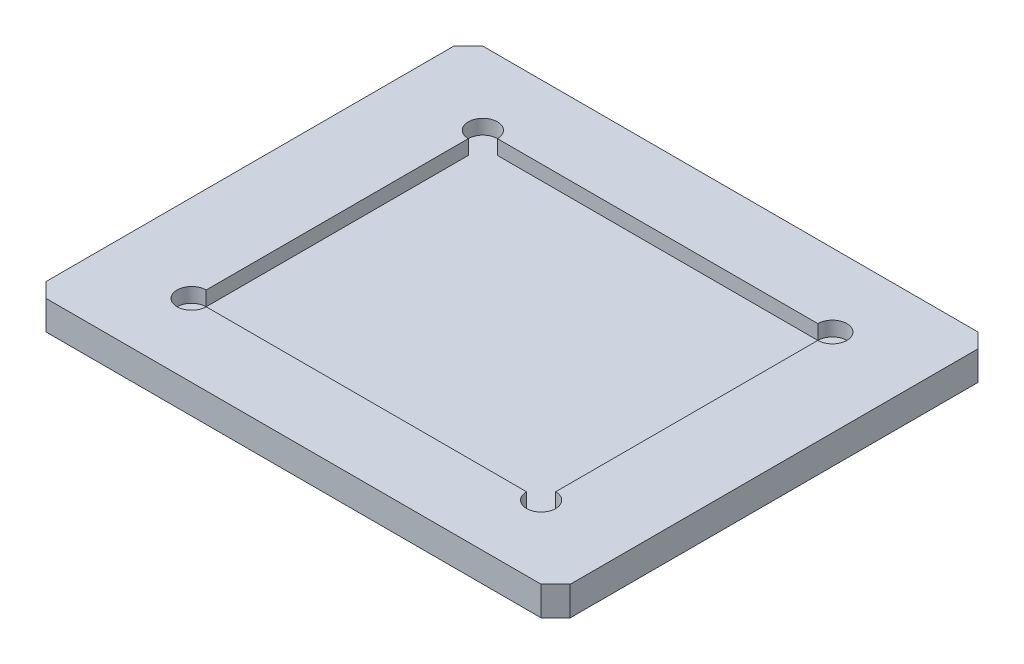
ISO-10303-21;
HEADER;
FILE_DESCRIPTION(('STEP AP214'),'2;1');
FILE_NAME('part.step','',(''),(''),'','','');
FILE_SCHEMA(('AUTOMOTIVE_DESIGN { 1 0 10303 214 1 1 1 1 }'));
ENDSEC;
DATA;
#1=APPLICATION_CONTEXT('core data for automotive mechanical design processes');
#2=APPLICATION_PROTOCOL_DEFINITION('international standard','automotive_design',2000,#1);
#3=PRODUCT_CONTEXT('',#1,'mechanical');
#4=PRODUCT('Part','Part','',(#3));
#5=PRODUCT_RELATED_PRODUCT_CATEGORY('part','',(#4));
#6=PRODUCT_DEFINITION_FORMATION('','',#4);
#7=PRODUCT_DEFINITION_CONTEXT('part definition',#1,'design');
#8=PRODUCT_DEFINITION('design','',#6,#7);
#9=PRODUCT_DEFINITION_SHAPE('','',#8);
#10=(LENGTH_UNIT() NAMED_UNIT(*) SI_UNIT(.MILLI.,.METRE.));
#11=(NAMED_UNIT(*) PLANE_ANGLE_UNIT() SI_UNIT($,.RADIAN.));
#12=(NAMED_UNIT(*) SI_UNIT($,.STERADIAN.) SOLID_ANGLE_UNIT());
#13=UNCERTAINTY_MEASURE_WITH_UNIT(LENGTH_MEASURE(1.E-05),#10,'distance_accuracy_value','');
#14=(GEOMETRIC_REPRESENTATION_CONTEXT(3) GLOBAL_UNCERTAINTY_ASSIGNED_CONTEXT((#13)) GLOBAL_UNIT_ASSIGNED_CONTEXT((#10,
#11,#12)) REPRESENTATION_CONTEXT('',''));
#15=CARTESIAN_POINT('',(0.,0.,0.));
#16=DIRECTION('',(0.,0.,1.));
#17=DIRECTION('',(1.,0.,0.));
#18=AXIS2_PLACEMENT_3D('',#15,#16,#17);
#19=CARTESIAN_POINT('',(90.,0.,75.));
#20=DIRECTION('',(1.,0.,0.));
#21=DIRECTION('',(0.,0.,-1.));
#22=AXIS2_PLACEMENT_3D('',#19,#20,#21);
#23=PLANE('',#22);
#24=DIRECTION('',(0.,0.,-1.));
#25=VECTOR('',#24,1.);
#26=CARTESIAN_POINT('',(90.,0.,75.));
#27=LINE('',#26,#25);
#28=CARTESIAN_POINT('',(90.,0.,70.));
#29=VERTEX_POINT('',#28);
#30=CARTESIAN_POINT('',(90.,0.,-70.));
#31=VERTEX_POINT('',#30);
#32=EDGE_CURVE('E225',#29,#31,#27,.T.);
#33=ORIENTED_EDGE('',*,*,#32,.T.);
#34=DIRECTION('',(0.,1.,0.));
#35=VECTOR('',#34,1.);
#36=CARTESIAN_POINT('',(90.,0.,-70.));
#37=LINE('',#36,#35);
#38=CARTESIAN_POINT('',(90.,10.,-70.));
#39=VERTEX_POINT('',#38);
#40=EDGE_CURVE('E258',#31,#39,#37,.T.);
#41=ORIENTED_EDGE('',*,*,#40,.T.);
#42=DIRECTION('',(0.,0.,-1.));
#43=VECTOR('',#42,1.);
#44=CARTESIAN_POINT('',(90.,10.,75.));
#45=LINE('',#44,#43);
#46=CARTESIAN_POINT('',(90.,10.,70.));
#47=VERTEX_POINT('',#46);
#48=EDGE_CURVE('E204',#47,#39,#45,.T.);
#49=ORIENTED_EDGE('',*,*,#48,.F.);
#50=DIRECTION('',(0.,-1.,0.));
#51=VECTOR('',#50,1.);
#52=CARTESIAN_POINT('',(90.,0.,70.));
#53=LINE('',#52,#51);
#54=EDGE_CURVE('E241',#47,#29,#53,.T.);
#55=ORIENTED_EDGE('',*,*,#54,.T.);
#56=EDGE_LOOP('',(#33,#41,#49,#55));
#57=FACE_BOUND('',#56,.T.);
#58=ADVANCED_FACE('F53',(#57),#23,.T.);
#59=CARTESIAN_POINT('',(-90.,0.,75.));
#60=DIRECTION('',(0.,0.,1.));
#61=DIRECTION('',(1.,0.,0.));
#62=AXIS2_PLACEMENT_3D('',#59,#60,#61);
#63=PLANE('',#62);
#64=DIRECTION('',(1.,0.,0.));
#65=VECTOR('',#64,1.);
#66=CARTESIAN_POINT('',(-90.,0.,75.));
#67=LINE('',#66,#65);
#68=CARTESIAN_POINT('',(-85.,0.,75.));
#69=VERTEX_POINT('',#68);
#70=CARTESIAN_POINT('',(84.9999999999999,0.,75.));
#71=VERTEX_POINT('',#70);
#72=EDGE_CURVE('E237',#69,#71,#67,.T.);
#73=ORIENTED_EDGE('',*,*,#72,.T.);
#74=DIRECTION('',(0.,1.,0.));
#75=VECTOR('',#74,1.);
#76=CARTESIAN_POINT('',(85.,0.,75.));
#77=LINE('',#76,#75);
#78=CARTESIAN_POINT('',(84.9999999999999,10.,75.));
#79=VERTEX_POINT('',#78);
#80=EDGE_CURVE('E12',#71,#79,#77,.T.);
#81=ORIENTED_EDGE('',*,*,#80,.T.);
#82=DIRECTION('',(1.,0.,0.));
#83=VECTOR('',#82,1.);
#84=CARTESIAN_POINT('',(-90.,10.,75.));
#85=LINE('',#84,#83);
#86=CARTESIAN_POINT('',(-85.,10.,75.));
#87=VERTEX_POINT('',#86);
#88=EDGE_CURVE('E230',#87,#79,#85,.T.);
#89=ORIENTED_EDGE('',*,*,#88,.F.);
#90=DIRECTION('',(0.,-1.,0.));
#91=VECTOR('',#90,1.);
#92=CARTESIAN_POINT('',(-85.,0.,75.));
#93=LINE('',#92,#91);
#94=EDGE_CURVE('E63',#87,#69,#93,.T.);
#95=ORIENTED_EDGE('',*,*,#94,.T.);
#96=EDGE_LOOP('',(#73,#81,#89,#95));
#97=FACE_BOUND('',#96,.T.);
#98=ADVANCED_FACE('F301',(#97),#63,.T.);
#99=CARTESIAN_POINT('',(-90.,0.,-75.));
#100=DIRECTION('',(-1.,0.,0.));
#101=DIRECTION('',(0.,0.,1.));
#102=AXIS2_PLACEMENT_3D('',#99,#100,#101);
#103=PLANE('',#102);
#104=DIRECTION('',(0.,0.,1.));
#105=VECTOR('',#104,1.);
#106=CARTESIAN_POINT('',(-90.,10.,-75.));
#107=LINE('',#106,#105);
#108=CARTESIAN_POINT('',(-90.,10.,-70.));
#109=VERTEX_POINT('',#108);
#110=CARTESIAN_POINT('',(-90.,10.,70.));
#111=VERTEX_POINT('',#110);
#112=EDGE_CURVE('E249',#109,#111,#107,.T.);
#113=ORIENTED_EDGE('',*,*,#112,.F.);
#114=DIRECTION('',(0.,-1.,0.));
#115=VECTOR('',#114,1.);
#116=CARTESIAN_POINT('',(-90.,0.,-70.));
#117=LINE('',#116,#115);
#118=CARTESIAN_POINT('',(-90.,0.,-70.));
#119=VERTEX_POINT('',#118);
#120=EDGE_CURVE('E77',#109,#119,#117,.T.);
#121=ORIENTED_EDGE('',*,*,#120,.T.);
#122=DIRECTION('',(0.,0.,1.));
#123=VECTOR('',#122,1.);
#124=CARTESIAN_POINT('',(-90.,0.,-75.));
#125=LINE('',#124,#123);
#126=CARTESIAN_POINT('',(-90.,0.,70.));
#127=VERTEX_POINT('',#126);
#128=EDGE_CURVE('E234',#119,#127,#125,.T.);
#129=ORIENTED_EDGE('',*,*,#128,.T.);
#130=DIRECTION('',(0.,1.,0.));
#131=VECTOR('',#130,1.);
#132=CARTESIAN_POINT('',(-90.,0.,70.));
#133=LINE('',#132,#131);
#134=EDGE_CURVE('E292',#127,#111,#133,.T.);
#135=ORIENTED_EDGE('',*,*,#134,.T.);
#136=EDGE_LOOP('',(#113,#121,#129,#135));
#137=FACE_BOUND('',#136,.T.);
#138=ADVANCED_FACE('F309',(#137),#103,.T.);
#139=CARTESIAN_POINT('',(90.,0.,-75.));
#140=DIRECTION('',(0.,0.,-1.));
#141=DIRECTION('',(-1.,0.,0.));
#142=AXIS2_PLACEMENT_3D('',#139,#140,#141);
#143=PLANE('',#142);
#144=DIRECTION('',(-1.,0.,0.));
#145=VECTOR('',#144,1.);
#146=CARTESIAN_POINT('',(90.,10.,-75.));
#147=LINE('',#146,#145);
#148=CARTESIAN_POINT('',(84.9999999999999,10.,-75.));
#149=VERTEX_POINT('',#148);
#150=CARTESIAN_POINT('',(-85.,10.,-75.));
#151=VERTEX_POINT('',#150);
#152=EDGE_CURVE('E245',#149,#151,#147,.T.);
#153=ORIENTED_EDGE('',*,*,#152,.F.);
#154=DIRECTION('',(0.,-1.,0.));
#155=VECTOR('',#154,1.);
#156=CARTESIAN_POINT('',(84.9999999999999,0.,-75.));
#157=LINE('',#156,#155);
#158=CARTESIAN_POINT('',(84.9999999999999,0.,-75.));
#159=VERTEX_POINT('',#158);
#160=EDGE_CURVE('E278',#149,#159,#157,.T.);
#161=ORIENTED_EDGE('',*,*,#160,.T.);
#162=DIRECTION('',(-1.,0.,0.));
#163=VECTOR('',#162,1.);
#164=CARTESIAN_POINT('',(90.,0.,-75.));
#165=LINE('',#164,#163);
#166=CARTESIAN_POINT('',(-85.,0.,-75.));
#167=VERTEX_POINT('',#166);
#168=EDGE_CURVE('E229',#159,#167,#165,.T.);
#169=ORIENTED_EDGE('',*,*,#168,.T.);
#170=DIRECTION('',(0.,1.,0.));
#171=VECTOR('',#170,1.);
#172=CARTESIAN_POINT('',(-85.,0.,-75.));
#173=LINE('',#172,#171);
#174=EDGE_CURVE('E274',#167,#151,#173,.T.);
#175=ORIENTED_EDGE('',*,*,#174,.T.);
#176=EDGE_LOOP('',(#153,#161,#169,#175));
#177=FACE_BOUND('',#176,.T.);
#178=ADVANCED_FACE('F318',(#177),#143,.T.);
#179=CARTESIAN_POINT('',(0.,0.,0.));
#180=DIRECTION('',(0.,1.,0.));
#181=DIRECTION('',(0.,0.,1.));
#182=AXIS2_PLACEMENT_3D('',#179,#180,#181);
#183=PLANE('',#182);
#184=ORIENTED_EDGE('',*,*,#168,.F.);
#185=DIRECTION('',(-0.707106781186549,0.,-0.707106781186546));
#186=VECTOR('',#185,1.);
#187=CARTESIAN_POINT('',(90.,0.,-70.));
#188=LINE('',#187,#186);
#189=EDGE_CURVE('E289',#159,#31,#188,.F.);
#190=ORIENTED_EDGE('',*,*,#189,.T.);
#191=ORIENTED_EDGE('',*,*,#32,.F.);
#192=DIRECTION('',(0.707106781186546,0.,-0.707106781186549));
#193=VECTOR('',#192,1.);
#194=CARTESIAN_POINT('',(85.,0.,75.));
#195=LINE('',#194,#193);
#196=EDGE_CURVE('E283',#29,#71,#195,.F.);
#197=ORIENTED_EDGE('',*,*,#196,.T.);
#198=ORIENTED_EDGE('',*,*,#72,.F.);
#199=DIRECTION('',(0.707106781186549,0.,0.707106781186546));
#200=VECTOR('',#199,1.);
#201=CARTESIAN_POINT('',(-90.,0.,70.));
#202=LINE('',#201,#200);
#203=EDGE_CURVE('E70',#69,#127,#202,.F.);
#204=ORIENTED_EDGE('',*,*,#203,.T.);
#205=ORIENTED_EDGE('',*,*,#128,.F.);
#206=DIRECTION('',(-0.707106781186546,0.,0.707106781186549));
#207=VECTOR('',#206,1.);
#208=CARTESIAN_POINT('',(-85.,0.,-75.));
#209=LINE('',#208,#207);
#210=EDGE_CURVE('E286',#119,#167,#209,.F.);
#211=ORIENTED_EDGE('',*,*,#210,.T.);
#212=EDGE_LOOP('',(#184,#190,#191,#197,#198,#204,#205,#211));
#213=FACE_BOUND('',#212,.T.);
#214=ADVANCED_FACE('F305',(#213),#183,.F.);
#215=CARTESIAN_POINT('',(0.,10.,0.));
#216=DIRECTION('',(0.,1.,0.));
#217=DIRECTION('',(0.,0.,1.));
#218=AXIS2_PLACEMENT_3D('',#215,#216,#217);
#219=PLANE('',#218);
#220=CARTESIAN_POINT('',(60.,10.,50.));
#221=DIRECTION('',(0.,1.,0.));
#222=DIRECTION('',(0.,0.,1.));
#223=AXIS2_PLACEMENT_3D('',#220,#221,#222);
#224=CIRCLE('',#223,5.00000000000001);
#225=CARTESIAN_POINT('',(55.,10.,50.));
#226=VERTEX_POINT('',#225);
#227=CARTESIAN_POINT('',(60.,10.,45.));
#228=VERTEX_POINT('',#227);
#229=EDGE_CURVE('E192',#226,#228,#224,.T.);
#230=ORIENTED_EDGE('',*,*,#229,.F.);
#231=DIRECTION('',(1.,0.,0.));
#232=VECTOR('',#231,1.);
#233=CARTESIAN_POINT('',(-60.,10.,50.));
#234=LINE('',#233,#232);
#235=CARTESIAN_POINT('',(-55.,10.,50.));
#236=VERTEX_POINT('',#235);
#237=EDGE_CURVE('E190',#236,#226,#234,.T.);
#238=ORIENTED_EDGE('',*,*,#237,.F.);
#239=CARTESIAN_POINT('',(-60.,10.,50.));
#240=DIRECTION('',(0.,1.,0.));
#241=DIRECTION('',(0.,0.,1.));
#242=AXIS2_PLACEMENT_3D('',#239,#240,#241);
#243=CIRCLE('',#242,5.00000000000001);
#244=CARTESIAN_POINT('',(-60.,10.,45.));
#245=VERTEX_POINT('',#244);
#246=EDGE_CURVE('E524',#245,#236,#243,.T.);
#247=ORIENTED_EDGE('',*,*,#246,.F.);
#248=DIRECTION('',(0.,0.,1.));
#249=VECTOR('',#248,1.);
#250=CARTESIAN_POINT('',(-60.,10.,-50.));
#251=LINE('',#250,#249);
#252=CARTESIAN_POINT('',(-60.,10.,-45.));
#253=VERTEX_POINT('',#252);
#254=EDGE_CURVE('E214',#253,#245,#251,.T.);
#255=ORIENTED_EDGE('',*,*,#254,.F.);
#256=CARTESIAN_POINT('',(-60.,10.,-50.));
#257=DIRECTION('',(0.,1.,0.));
#258=DIRECTION('',(0.,0.,1.));
#259=AXIS2_PLACEMENT_3D('',#256,#257,#258);
#260=CIRCLE('',#259,5.00000000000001);
#261=CARTESIAN_POINT('',(-55.,10.,-50.));
#262=VERTEX_POINT('',#261);
#263=EDGE_CURVE('E181',#262,#253,#260,.T.);
#264=ORIENTED_EDGE('',*,*,#263,.F.);
#265=DIRECTION('',(-1.,0.,0.));
#266=VECTOR('',#265,1.);
#267=CARTESIAN_POINT('',(60.,10.,-50.));
#268=LINE('',#267,#266);
#269=CARTESIAN_POINT('',(55.,10.,-50.));
#270=VERTEX_POINT('',#269);
#271=EDGE_CURVE('E210',#270,#262,#268,.T.);
#272=ORIENTED_EDGE('',*,*,#271,.F.);
#273=CARTESIAN_POINT('',(60.,10.,-50.));
#274=DIRECTION('',(0.,1.,0.));
#275=DIRECTION('',(0.,0.,1.));
#276=AXIS2_PLACEMENT_3D('',#273,#274,#275);
#277=CIRCLE('',#276,5.00000000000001);
#278=CARTESIAN_POINT('',(60.,10.,-45.));
#279=VERTEX_POINT('',#278);
#280=EDGE_CURVE('E513',#279,#270,#277,.T.);
#281=ORIENTED_EDGE('',*,*,#280,.F.);
#282=DIRECTION('',(0.,0.,-1.));
#283=VECTOR('',#282,1.);
#284=CARTESIAN_POINT('',(60.,10.,50.));
#285=LINE('',#284,#283);
#286=EDGE_CURVE('E221',#228,#279,#285,.T.);
#287=ORIENTED_EDGE('',*,*,#286,.F.);
#288=EDGE_LOOP('',(#230,#238,#247,#255,#264,#272,#281,#287));
#289=FACE_BOUND('',#288,.T.);
#290=ORIENTED_EDGE('',*,*,#48,.T.);
#291=DIRECTION('',(0.707106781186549,0.,0.707106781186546));
#292=VECTOR('',#291,1.);
#293=CARTESIAN_POINT('',(79.9999999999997,10.,-80.0000000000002));
#294=LINE('',#293,#292);
#295=EDGE_CURVE('E271',#39,#149,#294,.F.);
#296=ORIENTED_EDGE('',*,*,#295,.T.);
#297=ORIENTED_EDGE('',*,*,#152,.T.);
#298=DIRECTION('',(0.707106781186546,0.,-0.707106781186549));
#299=VECTOR('',#298,1.);
#300=CARTESIAN_POINT('',(-80.0000000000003,10.,-79.9999999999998));
#301=LINE('',#300,#299);
#302=EDGE_CURVE('E268',#151,#109,#301,.F.);
#303=ORIENTED_EDGE('',*,*,#302,.T.);
#304=ORIENTED_EDGE('',*,*,#112,.T.);
#305=DIRECTION('',(-0.707106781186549,0.,-0.707106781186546));
#306=VECTOR('',#305,1.);
#307=CARTESIAN_POINT('',(-79.9999999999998,10.,80.0000000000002));
#308=LINE('',#307,#306);
#309=EDGE_CURVE('E262',#111,#87,#308,.F.);
#310=ORIENTED_EDGE('',*,*,#309,.T.);
#311=ORIENTED_EDGE('',*,*,#88,.T.);
#312=DIRECTION('',(-0.707106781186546,0.,0.707106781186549));
#313=VECTOR('',#312,1.);
#314=CARTESIAN_POINT('',(80.0000000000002,10.,79.9999999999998));
#315=LINE('',#314,#313);
#316=EDGE_CURVE('E265',#79,#47,#315,.F.);
#317=ORIENTED_EDGE('',*,*,#316,.T.);
#318=EDGE_LOOP('',(#290,#296,#297,#303,#304,#310,#311,#317));
#319=FACE_BOUND('',#318,.T.);
#320=ADVANCED_FACE('F311',(#289,#319),#219,.T.);
#321=CARTESIAN_POINT('',(60.,5.,-50.));
#322=DIRECTION('',(0.,0.,-1.));
#323=DIRECTION('',(-1.,0.,0.));
#324=AXIS2_PLACEMENT_3D('',#321,#322,#323);
#325=PLANE('',#324);
#326=ORIENTED_EDGE('',*,*,#271,.T.);
#327=DIRECTION('',(0.,1.,0.));
#328=VECTOR('',#327,1.);
#329=CARTESIAN_POINT('',(-55.,-9.14213562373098,-50.));
#330=LINE('',#329,#328);
#331=CARTESIAN_POINT('',(-55.,5.,-50.));
#332=VERTEX_POINT('',#331);
#333=EDGE_CURVE('E525',#332,#262,#330,.T.);
#334=ORIENTED_EDGE('',*,*,#333,.F.);
#335=DIRECTION('',(-1.,0.,0.));
#336=VECTOR('',#335,1.);
#337=CARTESIAN_POINT('',(60.,5.,-50.));
#338=LINE('',#337,#336);
#339=CARTESIAN_POINT('',(55.,5.,-50.));
#340=VERTEX_POINT('',#339);
#341=EDGE_CURVE('E206',#340,#332,#338,.T.);
#342=ORIENTED_EDGE('',*,*,#341,.F.);
#343=DIRECTION('',(0.,1.,0.));
#344=VECTOR('',#343,1.);
#345=CARTESIAN_POINT('',(55.,-9.14213562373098,-50.));
#346=LINE('',#345,#344);
#347=EDGE_CURVE('E533',#340,#270,#346,.T.);
#348=ORIENTED_EDGE('',*,*,#347,.T.);
#349=EDGE_LOOP('',(#326,#334,#342,#348));
#350=FACE_BOUND('',#349,.T.);
#351=ADVANCED_FACE('F381',(#350),#325,.F.);
#352=CARTESIAN_POINT('',(60.,5.,50.));
#353=DIRECTION('',(1.,0.,0.));
#354=DIRECTION('',(0.,0.,-1.));
#355=AXIS2_PLACEMENT_3D('',#352,#353,#354);
#356=PLANE('',#355);
#357=DIRECTION('',(0.,0.,-1.));
#358=VECTOR('',#357,1.);
#359=CARTESIAN_POINT('',(60.,5.,50.));
#360=LINE('',#359,#358);
#361=CARTESIAN_POINT('',(60.,5.,45.));
#362=VERTEX_POINT('',#361);
#363=CARTESIAN_POINT('',(60.,5.,-45.));
#364=VERTEX_POINT('',#363);
#365=EDGE_CURVE('E199',#362,#364,#360,.T.);
#366=ORIENTED_EDGE('',*,*,#365,.F.);
#367=DIRECTION('',(0.,1.,0.));
#368=VECTOR('',#367,1.);
#369=CARTESIAN_POINT('',(60.,-9.14213562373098,45.));
#370=LINE('',#369,#368);
#371=EDGE_CURVE('E175',#362,#228,#370,.T.);
#372=ORIENTED_EDGE('',*,*,#371,.T.);
#373=ORIENTED_EDGE('',*,*,#286,.T.);
#374=DIRECTION('',(0.,1.,0.));
#375=VECTOR('',#374,1.);
#376=CARTESIAN_POINT('',(60.,-9.14213562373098,-45.));
#377=LINE('',#376,#375);
#378=EDGE_CURVE('E516',#364,#279,#377,.T.);
#379=ORIENTED_EDGE('',*,*,#378,.F.);
#380=EDGE_LOOP('',(#366,#372,#373,#379));
#381=FACE_BOUND('',#380,.T.);
#382=ADVANCED_FACE('F378',(#381),#356,.F.);
#383=CARTESIAN_POINT('',(-60.,5.,50.));
#384=DIRECTION('',(0.,0.,1.));
#385=DIRECTION('',(1.,0.,0.));
#386=AXIS2_PLACEMENT_3D('',#383,#384,#385);
#387=PLANE('',#386);
#388=ORIENTED_EDGE('',*,*,#237,.T.);
#389=DIRECTION('',(0.,1.,0.));
#390=VECTOR('',#389,1.);
#391=CARTESIAN_POINT('',(55.,-9.14213562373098,50.));
#392=LINE('',#391,#390);
#393=CARTESIAN_POINT('',(55.,5.,50.));
#394=VERTEX_POINT('',#393);
#395=EDGE_CURVE('E172',#394,#226,#392,.T.);
#396=ORIENTED_EDGE('',*,*,#395,.F.);
#397=DIRECTION('',(1.,0.,0.));
#398=VECTOR('',#397,1.);
#399=CARTESIAN_POINT('',(-60.,5.,50.));
#400=LINE('',#399,#398);
#401=CARTESIAN_POINT('',(-55.,5.,50.));
#402=VERTEX_POINT('',#401);
#403=EDGE_CURVE('E188',#402,#394,#400,.T.);
#404=ORIENTED_EDGE('',*,*,#403,.F.);
#405=DIRECTION('',(0.,1.,0.));
#406=VECTOR('',#405,1.);
#407=CARTESIAN_POINT('',(-55.,-9.14213562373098,50.));
#408=LINE('',#407,#406);
#409=EDGE_CURVE('E215',#402,#236,#408,.T.);
#410=ORIENTED_EDGE('',*,*,#409,.T.);
#411=EDGE_LOOP('',(#388,#396,#404,#410));
#412=FACE_BOUND('',#411,.T.);
#413=ADVANCED_FACE('F186',(#412),#387,.F.);
#414=CARTESIAN_POINT('',(-60.,5.,-50.));
#415=DIRECTION('',(-1.,0.,0.));
#416=DIRECTION('',(0.,0.,1.));
#417=AXIS2_PLACEMENT_3D('',#414,#415,#416);
#418=PLANE('',#417);
#419=DIRECTION('',(0.,0.,1.));
#420=VECTOR('',#419,1.);
#421=CARTESIAN_POINT('',(-60.,5.,-50.));
#422=LINE('',#421,#420);
#423=CARTESIAN_POINT('',(-60.,5.,-45.));
#424=VERTEX_POINT('',#423);
#425=CARTESIAN_POINT('',(-60.,5.,45.));
#426=VERTEX_POINT('',#425);
#427=EDGE_CURVE('E200',#424,#426,#422,.T.);
#428=ORIENTED_EDGE('',*,*,#427,.F.);
#429=DIRECTION('',(0.,1.,0.));
#430=VECTOR('',#429,1.);
#431=CARTESIAN_POINT('',(-60.,-9.14213562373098,-45.));
#432=LINE('',#431,#430);
#433=EDGE_CURVE('E523',#424,#253,#432,.T.);
#434=ORIENTED_EDGE('',*,*,#433,.T.);
#435=ORIENTED_EDGE('',*,*,#254,.T.);
#436=DIRECTION('',(0.,1.,0.));
#437=VECTOR('',#436,1.);
#438=CARTESIAN_POINT('',(-60.,-9.14213562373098,45.));
#439=LINE('',#438,#437);
#440=EDGE_CURVE('E542',#245,#426,#439,.F.);
#441=ORIENTED_EDGE('',*,*,#440,.T.);
#442=EDGE_LOOP('',(#428,#434,#435,#441));
#443=FACE_BOUND('',#442,.T.);
#444=ADVANCED_FACE('F377',(#443),#418,.F.);
#445=CARTESIAN_POINT('',(0.,5.,0.));
#446=DIRECTION('',(0.,1.,0.));
#447=DIRECTION('',(0.,0.,1.));
#448=AXIS2_PLACEMENT_3D('',#445,#446,#447);
#449=PLANE('',#448);
#450=CARTESIAN_POINT('',(-60.,5.,50.));
#451=DIRECTION('',(0.,1.,0.));
#452=DIRECTION('',(0.,0.,1.));
#453=AXIS2_PLACEMENT_3D('',#450,#451,#452);
#454=CIRCLE('',#453,5.00000000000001);
#455=EDGE_CURVE('E197',#402,#426,#454,.F.);
#456=ORIENTED_EDGE('',*,*,#455,.F.);
#457=ORIENTED_EDGE('',*,*,#403,.T.);
#458=CARTESIAN_POINT('',(60.,5.,50.));
#459=DIRECTION('',(0.,1.,0.));
#460=DIRECTION('',(0.,0.,1.));
#461=AXIS2_PLACEMENT_3D('',#458,#459,#460);
#462=CIRCLE('',#461,5.00000000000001);
#463=EDGE_CURVE('E169',#362,#394,#462,.F.);
#464=ORIENTED_EDGE('',*,*,#463,.F.);
#465=ORIENTED_EDGE('',*,*,#365,.T.);
#466=CARTESIAN_POINT('',(60.,5.,-50.));
#467=DIRECTION('',(0.,1.,0.));
#468=DIRECTION('',(0.,0.,1.));
#469=AXIS2_PLACEMENT_3D('',#466,#467,#468);
#470=CIRCLE('',#469,5.00000000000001);
#471=EDGE_CURVE('E537',#340,#364,#470,.F.);
#472=ORIENTED_EDGE('',*,*,#471,.F.);
#473=ORIENTED_EDGE('',*,*,#341,.T.);
#474=CARTESIAN_POINT('',(-60.,5.,-50.));
#475=DIRECTION('',(0.,1.,0.));
#476=DIRECTION('',(0.,0.,1.));
#477=AXIS2_PLACEMENT_3D('',#474,#475,#476);
#478=CIRCLE('',#477,5.00000000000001);
#479=EDGE_CURVE('E520',#424,#332,#478,.F.);
#480=ORIENTED_EDGE('',*,*,#479,.F.);
#481=ORIENTED_EDGE('',*,*,#427,.T.);
#482=EDGE_LOOP('',(#456,#457,#464,#465,#472,#473,#480,#481));
#483=FACE_BOUND('',#482,.T.);
#484=ADVANCED_FACE('F195',(#483),#449,.T.);
#485=CARTESIAN_POINT('',(60.,-9.14213562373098,-50.));
#486=DIRECTION('',(0.,1.,0.));
#487=DIRECTION('',(0.,0.,1.));
#488=AXIS2_PLACEMENT_3D('',#485,#486,#487);
#489=CYLINDRICAL_SURFACE('',#488,5.00000000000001);
#490=ORIENTED_EDGE('',*,*,#471,.T.);
#491=ORIENTED_EDGE('',*,*,#378,.T.);
#492=ORIENTED_EDGE('',*,*,#280,.T.);
#493=ORIENTED_EDGE('',*,*,#347,.F.);
#494=EDGE_LOOP('',(#490,#491,#492,#493));
#495=FACE_BOUND('',#494,.T.);
#496=ADVANCED_FACE('F370',(#495),#489,.F.);
#497=CARTESIAN_POINT('',(-60.,-9.14213562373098,-50.));
#498=DIRECTION('',(0.,1.,0.));
#499=DIRECTION('',(0.,0.,1.));
#500=AXIS2_PLACEMENT_3D('',#497,#498,#499);
#501=CYLINDRICAL_SURFACE('',#500,5.00000000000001);
#502=ORIENTED_EDGE('',*,*,#479,.T.);
#503=ORIENTED_EDGE('',*,*,#333,.T.);
#504=ORIENTED_EDGE('',*,*,#263,.T.);
#505=ORIENTED_EDGE('',*,*,#433,.F.);
#506=EDGE_LOOP('',(#502,#503,#504,#505));
#507=FACE_BOUND('',#506,.T.);
#508=ADVANCED_FACE('F365',(#507),#501,.F.);
#509=CARTESIAN_POINT('',(60.,-9.14213562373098,50.));
#510=DIRECTION('',(0.,1.,0.));
#511=DIRECTION('',(0.,0.,1.));
#512=AXIS2_PLACEMENT_3D('',#509,#510,#511);
#513=CYLINDRICAL_SURFACE('',#512,5.00000000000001);
#514=ORIENTED_EDGE('',*,*,#463,.T.);
#515=ORIENTED_EDGE('',*,*,#395,.T.);
#516=ORIENTED_EDGE('',*,*,#229,.T.);
#517=ORIENTED_EDGE('',*,*,#371,.F.);
#518=EDGE_LOOP('',(#514,#515,#516,#517));
#519=FACE_BOUND('',#518,.T.);
#520=ADVANCED_FACE('F171',(#519),#513,.F.);
#521=CARTESIAN_POINT('',(-60.,-9.14213562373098,50.));
#522=DIRECTION('',(0.,1.,0.));
#523=DIRECTION('',(0.,0.,1.));
#524=AXIS2_PLACEMENT_3D('',#521,#522,#523);
#525=CYLINDRICAL_SURFACE('',#524,5.00000000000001);
#526=ORIENTED_EDGE('',*,*,#455,.T.);
#527=ORIENTED_EDGE('',*,*,#440,.F.);
#528=ORIENTED_EDGE('',*,*,#246,.T.);
#529=ORIENTED_EDGE('',*,*,#409,.F.);
#530=EDGE_LOOP('',(#526,#527,#528,#529));
#531=FACE_BOUND('',#530,.T.);
#532=ADVANCED_FACE('F350',(#531),#525,.F.);
#533=CARTESIAN_POINT('',(90.,0.,-70.));
#534=DIRECTION('',(-0.707106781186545,0.,0.707106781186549));
#535=DIRECTION('',(0.,1.,0.));
#536=AXIS2_PLACEMENT_3D('',#533,#534,#535);
#537=PLANE('',#536);
#538=ORIENTED_EDGE('',*,*,#189,.F.);
#539=ORIENTED_EDGE('',*,*,#160,.F.);
#540=ORIENTED_EDGE('',*,*,#295,.F.);
#541=ORIENTED_EDGE('',*,*,#40,.F.);
#542=EDGE_LOOP('',(#538,#539,#540,#541));
#543=FACE_BOUND('',#542,.T.);
#544=ADVANCED_FACE('F323',(#543),#537,.F.);
#545=CARTESIAN_POINT('',(-85.,0.,-75.));
#546=DIRECTION('',(0.707106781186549,0.,0.707106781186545));
#547=DIRECTION('',(0.,1.,0.));
#548=AXIS2_PLACEMENT_3D('',#545,#546,#547);
#549=PLANE('',#548);
#550=ORIENTED_EDGE('',*,*,#210,.F.);
#551=ORIENTED_EDGE('',*,*,#120,.F.);
#552=ORIENTED_EDGE('',*,*,#302,.F.);
#553=ORIENTED_EDGE('',*,*,#174,.F.);
#554=EDGE_LOOP('',(#550,#551,#552,#553));
#555=FACE_BOUND('',#554,.T.);
#556=ADVANCED_FACE('F316',(#555),#549,.F.);
#557=CARTESIAN_POINT('',(85.,0.,75.));
#558=DIRECTION('',(-0.707106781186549,0.,-0.707106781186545));
#559=DIRECTION('',(0.,1.,0.));
#560=AXIS2_PLACEMENT_3D('',#557,#558,#559);
#561=PLANE('',#560);
#562=ORIENTED_EDGE('',*,*,#196,.F.);
#563=ORIENTED_EDGE('',*,*,#54,.F.);
#564=ORIENTED_EDGE('',*,*,#316,.F.);
#565=ORIENTED_EDGE('',*,*,#80,.F.);
#566=EDGE_LOOP('',(#562,#563,#564,#565));
#567=FACE_BOUND('',#566,.T.);
#568=ADVANCED_FACE('F328',(#567),#561,.F.);
#569=CARTESIAN_POINT('',(-90.,0.,70.));
#570=DIRECTION('',(0.707106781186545,0.,-0.707106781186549));
#571=DIRECTION('',(0.,1.,0.));
#572=AXIS2_PLACEMENT_3D('',#569,#570,#571);
#573=PLANE('',#572);
#574=ORIENTED_EDGE('',*,*,#203,.F.);
#575=ORIENTED_EDGE('',*,*,#94,.F.);
#576=ORIENTED_EDGE('',*,*,#309,.F.);
#577=ORIENTED_EDGE('',*,*,#134,.F.);
#578=EDGE_LOOP('',(#574,#575,#576,#577));
#579=FACE_BOUND('',#578,.T.);
#580=ADVANCED_FACE('F56',(#579),#573,.F.);
#581=CLOSED_SHELL('',(#58,#98,#138,#178,#214,#320,#351,#382,#413,#444,#484,#496,#508,#520,#532,
#544,#556,#568,#580));
#582=MANIFOLD_SOLID_BREP('B2',#581);
#583=ADVANCED_BREP_SHAPE_REPRESENTATION('',(#18,#582),#14);
#584=SHAPE_DEFINITION_REPRESENTATION(#9,#583);
ENDSEC;
END-ISO-10303-21;
